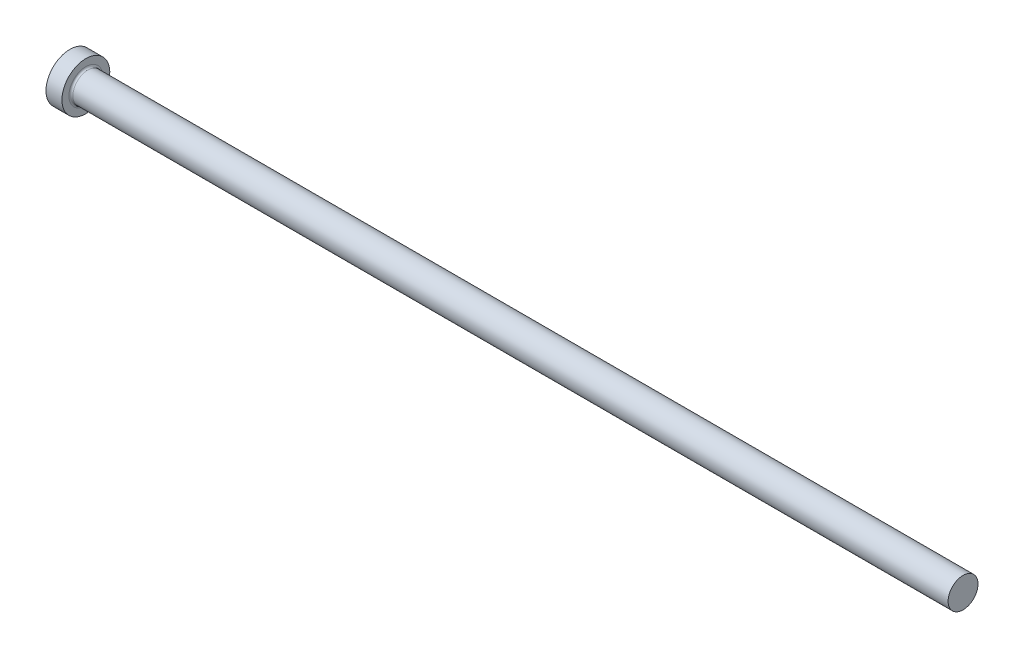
ISO-10303-21;
HEADER;
FILE_DESCRIPTION(('STEP AP214'),'2;1');
FILE_NAME('part.step','',(''),(''),'','','');
FILE_SCHEMA(('AUTOMOTIVE_DESIGN { 1 0 10303 214 1 1 1 1 }'));
ENDSEC;
DATA;
#1=APPLICATION_CONTEXT('core data for automotive mechanical design processes');
#2=APPLICATION_PROTOCOL_DEFINITION('international standard','automotive_design',2000,#1);
#3=PRODUCT_CONTEXT('',#1,'mechanical');
#4=PRODUCT('Part','Part','',(#3));
#5=PRODUCT_RELATED_PRODUCT_CATEGORY('part','',(#4));
#6=PRODUCT_DEFINITION_FORMATION('','',#4);
#7=PRODUCT_DEFINITION_CONTEXT('part definition',#1,'design');
#8=PRODUCT_DEFINITION('design','',#6,#7);
#9=PRODUCT_DEFINITION_SHAPE('','',#8);
#10=(LENGTH_UNIT() NAMED_UNIT(*) SI_UNIT(.MILLI.,.METRE.));
#11=(NAMED_UNIT(*) PLANE_ANGLE_UNIT() SI_UNIT($,.RADIAN.));
#12=(NAMED_UNIT(*) SI_UNIT($,.STERADIAN.) SOLID_ANGLE_UNIT());
#13=UNCERTAINTY_MEASURE_WITH_UNIT(LENGTH_MEASURE(1.E-05),#10,'distance_accuracy_value','');
#14=(GEOMETRIC_REPRESENTATION_CONTEXT(3) GLOBAL_UNCERTAINTY_ASSIGNED_CONTEXT((#13)) GLOBAL_UNIT_ASSIGNED_CONTEXT((#10,
#11,#12)) REPRESENTATION_CONTEXT('',''));
#15=CARTESIAN_POINT('',(0.,0.,0.));
#16=DIRECTION('',(0.,0.,1.));
#17=DIRECTION('',(1.,0.,0.));
#18=AXIS2_PLACEMENT_3D('',#15,#16,#17);
#19=CARTESIAN_POINT('',(0.,0.,0.));
#20=DIRECTION('',(1.,0.,0.));
#21=DIRECTION('',(0.,1.,0.));
#22=AXIS2_PLACEMENT_3D('',#19,#20,#21);
#23=PLANE('',#22);
#24=CARTESIAN_POINT('',(0.,0.,0.));
#25=DIRECTION('',(-1.,0.,0.));
#26=DIRECTION('',(0.,-1.,0.));
#27=AXIS2_PLACEMENT_3D('',#24,#25,#26);
#28=CIRCLE('',#27,9.52499999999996);
#29=CARTESIAN_POINT('',(0.,-9.52499999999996,0.));
#30=VERTEX_POINT('',#29);
#31=EDGE_CURVE('E10',#30,#30,#28,.T.);
#32=ORIENTED_EDGE('',*,*,#31,.T.);
#33=EDGE_LOOP('',(#32));
#34=FACE_BOUND('',#33,.T.);
#35=ADVANCED_FACE('F28',(#34),#23,.F.);
#36=CARTESIAN_POINT('',(355.6,0.,0.));
#37=DIRECTION('',(-1.,0.,0.));
#38=DIRECTION('',(0.,-1.,0.));
#39=AXIS2_PLACEMENT_3D('',#36,#37,#38);
#40=CYLINDRICAL_SURFACE('',#39,9.52499999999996);
#41=ORIENTED_EDGE('',*,*,#31,.F.);
#42=EDGE_LOOP('',(#41));
#43=FACE_BOUND('',#42,.T.);
#44=CARTESIAN_POINT('',(6.35000000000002,0.,0.));
#45=DIRECTION('',(-1.,0.,0.));
#46=DIRECTION('',(0.,-1.,0.));
#47=AXIS2_PLACEMENT_3D('',#44,#45,#46);
#48=CIRCLE('',#47,9.52499999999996);
#49=CARTESIAN_POINT('',(6.35000000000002,-9.52499999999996,0.));
#50=VERTEX_POINT('',#49);
#51=EDGE_CURVE('E34',#50,#50,#48,.T.);
#52=ORIENTED_EDGE('',*,*,#51,.T.);
#53=EDGE_LOOP('',(#52));
#54=FACE_BOUND('',#53,.T.);
#55=ADVANCED_FACE('F63',(#43,#54),#40,.T.);
#56=CARTESIAN_POINT('',(6.35,9.52499999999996,0.));
#57=DIRECTION('',(-1.,0.,0.));
#58=DIRECTION('',(0.,-1.,0.));
#59=AXIS2_PLACEMENT_3D('',#56,#57,#58);
#60=PLANE('',#59);
#61=ORIENTED_EDGE('',*,*,#51,.F.);
#62=EDGE_LOOP('',(#61));
#63=FACE_BOUND('',#62,.T.);
#64=CARTESIAN_POINT('',(6.35000000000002,0.,0.));
#65=DIRECTION('',(-1.,0.,0.));
#66=DIRECTION('',(0.,-1.,0.));
#67=AXIS2_PLACEMENT_3D('',#64,#65,#66);
#68=CIRCLE('',#67,6.73989);
#69=CARTESIAN_POINT('',(6.35000000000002,-6.73989,0.));
#70=VERTEX_POINT('',#69);
#71=EDGE_CURVE('E38',#70,#70,#68,.T.);
#72=ORIENTED_EDGE('',*,*,#71,.T.);
#73=EDGE_LOOP('',(#72));
#74=FACE_BOUND('',#73,.T.);
#75=ADVANCED_FACE('F67',(#63,#74),#60,.F.);
#76=CARTESIAN_POINT('',(7.1374,0.,0.));
#77=DIRECTION('',(-1.,0.,0.));
#78=DIRECTION('',(0.,-1.,0.));
#79=AXIS2_PLACEMENT_3D('',#76,#77,#78);
#80=TOROIDAL_SURFACE('',#79,6.73989,0.7874);
#81=ORIENTED_EDGE('',*,*,#71,.F.);
#82=EDGE_LOOP('',(#81));
#83=FACE_BOUND('',#82,.T.);
#84=CARTESIAN_POINT('',(7.13740000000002,0.,0.));
#85=DIRECTION('',(-1.,0.,0.));
#86=DIRECTION('',(0.,-1.,0.));
#87=AXIS2_PLACEMENT_3D('',#84,#85,#86);
#88=CIRCLE('',#87,5.95249);
#89=CARTESIAN_POINT('',(7.13740000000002,-5.95249,0.));
#90=VERTEX_POINT('',#89);
#91=EDGE_CURVE('E42',#90,#90,#88,.T.);
#92=ORIENTED_EDGE('',*,*,#91,.T.);
#93=EDGE_LOOP('',(#92));
#94=FACE_BOUND('',#93,.T.);
#95=ADVANCED_FACE('F59',(#83,#94),#80,.F.);
#96=CARTESIAN_POINT('',(355.6,0.,0.));
#97=DIRECTION('',(-1.,0.,0.));
#98=DIRECTION('',(0.,-1.,0.));
#99=AXIS2_PLACEMENT_3D('',#96,#97,#98);
#100=CYLINDRICAL_SURFACE('',#99,5.95248999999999);
#101=ORIENTED_EDGE('',*,*,#91,.F.);
#102=EDGE_LOOP('',(#101));
#103=FACE_BOUND('',#102,.T.);
#104=CARTESIAN_POINT('',(355.6,0.,0.));
#105=DIRECTION('',(-1.,0.,0.));
#106=DIRECTION('',(0.,-1.,0.));
#107=AXIS2_PLACEMENT_3D('',#104,#105,#106);
#108=CIRCLE('',#107,5.95248999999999);
#109=CARTESIAN_POINT('',(355.6,-5.95248999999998,0.));
#110=VERTEX_POINT('',#109);
#111=EDGE_CURVE('E47',#110,#110,#108,.T.);
#112=ORIENTED_EDGE('',*,*,#111,.T.);
#113=EDGE_LOOP('',(#112));
#114=FACE_BOUND('',#113,.T.);
#115=ADVANCED_FACE('F51',(#103,#114),#100,.T.);
#116=CARTESIAN_POINT('',(355.6,5.95249,0.));
#117=DIRECTION('',(-1.,0.,0.));
#118=DIRECTION('',(0.,-1.,0.));
#119=AXIS2_PLACEMENT_3D('',#116,#117,#118);
#120=PLANE('',#119);
#121=ORIENTED_EDGE('',*,*,#111,.F.);
#122=EDGE_LOOP('',(#121));
#123=FACE_BOUND('',#122,.T.);
#124=ADVANCED_FACE('F53',(#123),#120,.F.);
#125=CLOSED_SHELL('',(#35,#55,#75,#95,#115,#124));
#126=MANIFOLD_SOLID_BREP('B2',#125);
#127=ADVANCED_BREP_SHAPE_REPRESENTATION('',(#18,#126),#14);
#128=SHAPE_DEFINITION_REPRESENTATION(#9,#127);
ENDSEC;
END-ISO-10303-21;
